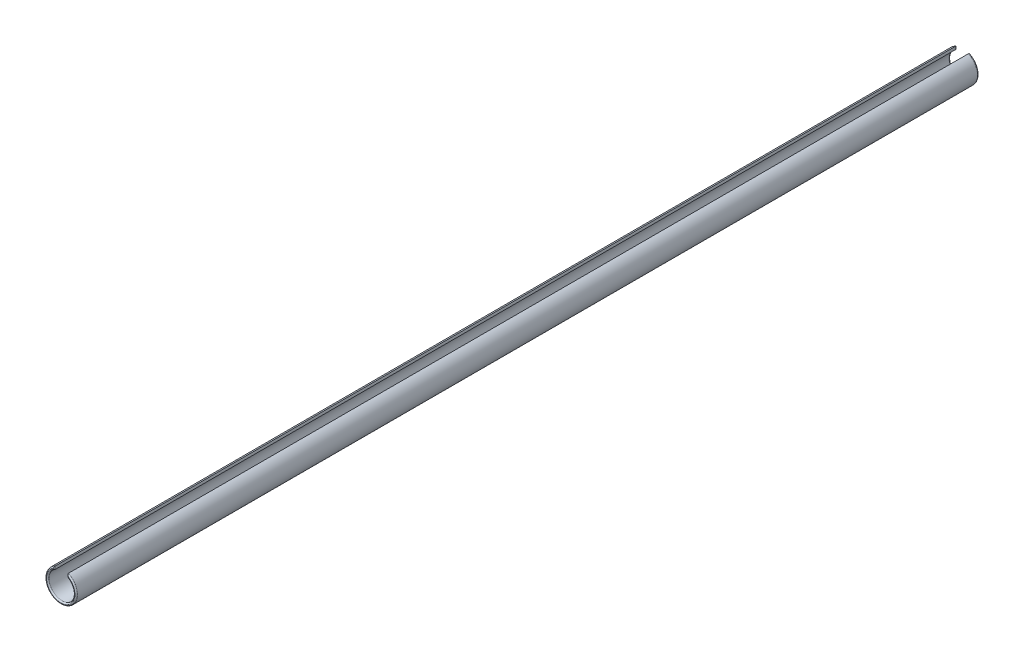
ISO-10303-21;
HEADER;
FILE_DESCRIPTION(('STEP AP214'),'2;1');
FILE_NAME('part.step','',(''),(''),'','','');
FILE_SCHEMA(('AUTOMOTIVE_DESIGN { 1 0 10303 214 1 1 1 1 }'));
ENDSEC;
DATA;
#1=APPLICATION_CONTEXT('core data for automotive mechanical design processes');
#2=APPLICATION_PROTOCOL_DEFINITION('international standard','automotive_design',2000,#1);
#3=PRODUCT_CONTEXT('',#1,'mechanical');
#4=PRODUCT('Part','Part','',(#3));
#5=PRODUCT_RELATED_PRODUCT_CATEGORY('part','',(#4));
#6=PRODUCT_DEFINITION_FORMATION('','',#4);
#7=PRODUCT_DEFINITION_CONTEXT('part definition',#1,'design');
#8=PRODUCT_DEFINITION('design','',#6,#7);
#9=PRODUCT_DEFINITION_SHAPE('','',#8);
#10=(LENGTH_UNIT() NAMED_UNIT(*) SI_UNIT(.MILLI.,.METRE.));
#11=(NAMED_UNIT(*) PLANE_ANGLE_UNIT() SI_UNIT($,.RADIAN.));
#12=(NAMED_UNIT(*) SI_UNIT($,.STERADIAN.) SOLID_ANGLE_UNIT());
#13=UNCERTAINTY_MEASURE_WITH_UNIT(LENGTH_MEASURE(1.E-05),#10,'distance_accuracy_value','');
#14=(GEOMETRIC_REPRESENTATION_CONTEXT(3) GLOBAL_UNCERTAINTY_ASSIGNED_CONTEXT((#13)) GLOBAL_UNIT_ASSIGNED_CONTEXT((#10,
#11,#12)) REPRESENTATION_CONTEXT('',''));
#15=CARTESIAN_POINT('',(0.,0.,0.));
#16=DIRECTION('',(0.,0.,1.));
#17=DIRECTION('',(1.,0.,0.));
#18=AXIS2_PLACEMENT_3D('',#15,#16,#17);
#19=CARTESIAN_POINT('',(0.,0.,35.));
#20=DIRECTION('',(0.,0.,-1.));
#21=DIRECTION('',(-1.,0.,0.));
#22=AXIS2_PLACEMENT_3D('',#19,#20,#21);
#23=CYLINDRICAL_SURFACE('',#22,0.6);
#24=DIRECTION('',(0.,0.,-1.));
#25=VECTOR('',#24,1.);
#26=CARTESIAN_POINT('',(-0.249999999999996,0.545435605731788,35.));
#27=LINE('',#26,#25);
#28=CARTESIAN_POINT('',(-0.249999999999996,0.545435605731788,0.0499999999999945));
#29=VERTEX_POINT('',#28);
#30=CARTESIAN_POINT('',(-0.249999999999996,0.545435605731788,34.95));
#31=VERTEX_POINT('',#30);
#32=EDGE_CURVE('E205',#29,#31,#27,.F.);
#33=ORIENTED_EDGE('',*,*,#32,.F.);
#34=CARTESIAN_POINT('',(0.,0.,0.0500000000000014));
#35=DIRECTION('',(0.,0.,1.));
#36=DIRECTION('',(1.,0.,0.));
#37=AXIS2_PLACEMENT_3D('',#34,#35,#36);
#38=CIRCLE('',#37,0.6);
#39=CARTESIAN_POINT('',(0.250000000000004,0.545435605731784,0.0499999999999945));
#40=VERTEX_POINT('',#39);
#41=EDGE_CURVE('E11',#29,#40,#38,.T.);
#42=ORIENTED_EDGE('',*,*,#41,.T.);
#43=DIRECTION('',(0.,0.,-1.));
#44=VECTOR('',#43,1.);
#45=CARTESIAN_POINT('',(0.250000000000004,0.545435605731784,35.));
#46=LINE('',#45,#44);
#47=CARTESIAN_POINT('',(0.250000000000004,0.545435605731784,34.95));
#48=VERTEX_POINT('',#47);
#49=EDGE_CURVE('E198',#48,#40,#46,.T.);
#50=ORIENTED_EDGE('',*,*,#49,.F.);
#51=CARTESIAN_POINT('',(0.,0.,34.95));
#52=DIRECTION('',(0.,0.,1.));
#53=DIRECTION('',(1.,0.,0.));
#54=AXIS2_PLACEMENT_3D('',#51,#52,#53);
#55=CIRCLE('',#54,0.6);
#56=EDGE_CURVE('E45',#48,#31,#55,.F.);
#57=ORIENTED_EDGE('',*,*,#56,.T.);
#58=EDGE_LOOP('',(#33,#42,#50,#57));
#59=FACE_BOUND('',#58,.T.);
#60=ADVANCED_FACE('F31',(#59),#23,.T.);
#61=CARTESIAN_POINT('',(0.,0.,0.));
#62=DIRECTION('',(0.,0.,1.));
#63=DIRECTION('',(1.,0.,0.));
#64=AXIS2_PLACEMENT_3D('',#61,#62,#63);
#65=CYLINDRICAL_SURFACE('',#64,0.5);
#66=DIRECTION('',(0.,0.,1.));
#67=VECTOR('',#66,1.);
#68=CARTESIAN_POINT('',(0.25,0.433012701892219,0.));
#69=LINE('',#68,#67);
#70=CARTESIAN_POINT('',(0.25,0.433012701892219,0.05));
#71=VERTEX_POINT('',#70);
#72=CARTESIAN_POINT('',(0.25,0.433012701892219,34.95));
#73=VERTEX_POINT('',#72);
#74=EDGE_CURVE('E197',#71,#73,#69,.T.);
#75=ORIENTED_EDGE('',*,*,#74,.F.);
#76=CARTESIAN_POINT('',(0.,0.,0.05));
#77=DIRECTION('',(0.,0.,1.));
#78=DIRECTION('',(1.,0.,0.));
#79=AXIS2_PLACEMENT_3D('',#76,#77,#78);
#80=CIRCLE('',#79,0.5);
#81=CARTESIAN_POINT('',(-0.25,0.433012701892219,0.05));
#82=VERTEX_POINT('',#81);
#83=EDGE_CURVE('E186',#71,#82,#80,.F.);
#84=ORIENTED_EDGE('',*,*,#83,.T.);
#85=DIRECTION('',(0.,0.,1.));
#86=VECTOR('',#85,1.);
#87=CARTESIAN_POINT('',(-0.25,0.433012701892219,0.));
#88=LINE('',#87,#86);
#89=CARTESIAN_POINT('',(-0.25,0.433012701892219,34.95));
#90=VERTEX_POINT('',#89);
#91=EDGE_CURVE('E201',#90,#82,#88,.F.);
#92=ORIENTED_EDGE('',*,*,#91,.F.);
#93=CARTESIAN_POINT('',(0.,0.,34.95));
#94=DIRECTION('',(0.,0.,1.));
#95=DIRECTION('',(1.,0.,0.));
#96=AXIS2_PLACEMENT_3D('',#93,#94,#95);
#97=CIRCLE('',#96,0.5);
#98=EDGE_CURVE('E192',#90,#73,#97,.T.);
#99=ORIENTED_EDGE('',*,*,#98,.T.);
#100=EDGE_LOOP('',(#75,#84,#92,#99));
#101=FACE_BOUND('',#100,.T.);
#102=ADVANCED_FACE('F127',(#101),#65,.F.);
#103=CARTESIAN_POINT('',(0.250000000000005,-0.601,35.6131131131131));
#104=DIRECTION('',(1.,0.,0.));
#105=DIRECTION('',(0.,0.,-1.));
#106=AXIS2_PLACEMENT_3D('',#103,#104,#105);
#107=PLANE('',#106);
#108=ORIENTED_EDGE('',*,*,#49,.T.);
#109=DIRECTION('',(0.,-1.,0.));
#110=VECTOR('',#109,1.);
#111=CARTESIAN_POINT('',(0.25,-0.601,0.0500000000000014));
#112=LINE('',#111,#110);
#113=EDGE_CURVE('E183',#40,#71,#112,.T.);
#114=ORIENTED_EDGE('',*,*,#113,.T.);
#115=ORIENTED_EDGE('',*,*,#74,.T.);
#116=DIRECTION('',(0.,-1.,0.));
#117=VECTOR('',#116,1.);
#118=CARTESIAN_POINT('',(0.250000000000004,0.545435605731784,34.95));
#119=LINE('',#118,#117);
#120=EDGE_CURVE('E93',#73,#48,#119,.F.);
#121=ORIENTED_EDGE('',*,*,#120,.T.);
#122=EDGE_LOOP('',(#108,#114,#115,#121));
#123=FACE_BOUND('',#122,.T.);
#124=ADVANCED_FACE('F132',(#123),#107,.F.);
#125=CARTESIAN_POINT('',(-0.249999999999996,-0.601,35.6131131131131));
#126=DIRECTION('',(-1.,0.,0.));
#127=DIRECTION('',(0.,0.,1.));
#128=AXIS2_PLACEMENT_3D('',#125,#126,#127);
#129=PLANE('',#128);
#130=ORIENTED_EDGE('',*,*,#91,.T.);
#131=DIRECTION('',(0.,1.,0.));
#132=VECTOR('',#131,1.);
#133=CARTESIAN_POINT('',(-0.25,-0.601,0.0500000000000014));
#134=LINE('',#133,#132);
#135=EDGE_CURVE('E211',#82,#29,#134,.T.);
#136=ORIENTED_EDGE('',*,*,#135,.T.);
#137=ORIENTED_EDGE('',*,*,#32,.T.);
#138=DIRECTION('',(0.,1.,0.));
#139=VECTOR('',#138,1.);
#140=CARTESIAN_POINT('',(-0.249999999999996,0.433012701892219,34.95));
#141=LINE('',#140,#139);
#142=EDGE_CURVE('E191',#31,#90,#141,.F.);
#143=ORIENTED_EDGE('',*,*,#142,.T.);
#144=EDGE_LOOP('',(#130,#136,#137,#143));
#145=FACE_BOUND('',#144,.T.);
#146=ADVANCED_FACE('F161',(#145),#129,.F.);
#147=CARTESIAN_POINT('',(-0.3,-0.601,0.0500000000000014));
#148=DIRECTION('',(0.,1.,0.));
#149=DIRECTION('',(0.,0.,1.));
#150=AXIS2_PLACEMENT_3D('',#147,#148,#149);
#151=CYLINDRICAL_SURFACE('',#150,0.05);
#152=CARTESIAN_POINT('',(-0.249999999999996,0.545435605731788,0.049999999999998));
#153=CARTESIAN_POINT('',(-0.249997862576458,0.545438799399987,0.0483828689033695));
#154=CARTESIAN_POINT('',(-0.250078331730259,0.545313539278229,0.0467699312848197));
#155=CARTESIAN_POINT('',(-0.250385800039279,0.544834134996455,0.0436065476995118));
#156=CARTESIAN_POINT('',(-0.250611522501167,0.544481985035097,0.0420556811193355));
#157=CARTESIAN_POINT('',(-0.251190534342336,0.543577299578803,0.0390455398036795));
#158=CARTESIAN_POINT('',(-0.251543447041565,0.543025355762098,0.0375860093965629));
#159=CARTESIAN_POINT('',(-0.252353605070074,0.541755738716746,0.0347693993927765));
#160=CARTESIAN_POINT('',(-0.252811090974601,0.541037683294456,0.0334125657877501));
#161=CARTESIAN_POINT('',(-0.254146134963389,0.538937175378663,0.0299276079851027));
#162=CARTESIAN_POINT('',(-0.255098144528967,0.537434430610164,0.0279005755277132));
#163=CARTESIAN_POINT('',(-0.257150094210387,0.534179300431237,0.0241449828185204));
#164=CARTESIAN_POINT('',(-0.258250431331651,0.532426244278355,0.0224172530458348));
#165=CARTESIAN_POINT('',(-0.261342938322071,0.527471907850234,0.0181126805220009));
#166=CARTESIAN_POINT('',(-0.263422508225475,0.524112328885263,0.0157825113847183));
#167=CARTESIAN_POINT('',(-0.267702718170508,0.517124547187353,0.0117173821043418));
#168=CARTESIAN_POINT('',(-0.269903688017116,0.513495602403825,0.00998414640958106));
#169=CARTESIAN_POINT('',(-0.276626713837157,0.502285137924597,0.00546545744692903));
#170=CARTESIAN_POINT('',(-0.281222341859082,0.494453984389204,0.00341463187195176));
#171=CARTESIAN_POINT('',(-0.290330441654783,0.478541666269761,0.00071693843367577));
#172=CARTESIAN_POINT('',(-0.294842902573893,0.470460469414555,7.0252564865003E-05));
#173=CARTESIAN_POINT('',(-0.299508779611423,0.461882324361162,1.82765757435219E-06));
#174=CARTESIAN_POINT('',(-0.299754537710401,0.461429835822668,2.2613212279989E-08));
#175=CARTESIAN_POINT('',(-0.3,0.460977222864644,0.));
#176=B_SPLINE_CURVE_WITH_KNOTS('',3,(#152,#153,#154,#155,#156,#157,#158,#159,#160,#161,#162,
#163,#164,#165,#166,#167,#168,#169,#170,#171,#172,#173,#174,#175),.UNSPECIFIED.,.F.,.F.,(4,2,2,
2,2,2,2,2,2,2,2,4),(0.,0.00483788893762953,0.00963382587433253,0.0144156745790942,
0.0192086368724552,0.0272526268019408,0.0353185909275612,0.0490021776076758,0.0627249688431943,
0.0904705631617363,0.118219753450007,0.119764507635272),.UNSPECIFIED.);
#177=CARTESIAN_POINT('',(-0.29999999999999,0.460977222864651,0.));
#178=VERTEX_POINT('',#177);
#179=EDGE_CURVE('E103',#29,#178,#176,.T.);
#180=ORIENTED_EDGE('',*,*,#179,.F.);
#181=ORIENTED_EDGE('',*,*,#135,.F.);
#182=CARTESIAN_POINT('',(-0.25,0.433012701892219,0.05));
#183=CARTESIAN_POINT('',(-0.249996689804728,0.433010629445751,0.0474512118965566));
#184=CARTESIAN_POINT('',(-0.250194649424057,0.433125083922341,0.0449054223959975));
#185=CARTESIAN_POINT('',(-0.250966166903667,0.43357025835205,0.0399019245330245));
#186=CARTESIAN_POINT('',(-0.251538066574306,0.433900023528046,0.0374438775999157));
#187=CARTESIAN_POINT('',(-0.253030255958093,0.434758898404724,0.032676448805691));
#188=CARTESIAN_POINT('',(-0.253950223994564,0.435287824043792,0.0303669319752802));
#189=CARTESIAN_POINT('',(-0.256097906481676,0.436519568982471,0.0259448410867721));
#190=CARTESIAN_POINT('',(-0.257325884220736,0.43722253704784,0.0238324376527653));
#191=CARTESIAN_POINT('',(-0.260117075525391,0.43881568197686,0.0197374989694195));
#192=CARTESIAN_POINT('',(-0.261694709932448,0.439713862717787,0.0177679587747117));
#193=CARTESIAN_POINT('',(-0.265088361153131,0.441639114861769,0.0141197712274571));
#194=CARTESIAN_POINT('',(-0.266904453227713,0.442666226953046,0.0124412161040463));
#195=CARTESIAN_POINT('',(-0.270969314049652,0.444956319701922,0.00919790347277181));
#196=CARTESIAN_POINT('',(-0.273243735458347,0.446232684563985,0.00767477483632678));
#197=CARTESIAN_POINT('',(-0.277970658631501,0.448873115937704,0.00503281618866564));
#198=CARTESIAN_POINT('',(-0.280423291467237,0.450237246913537,0.00391428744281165));
#199=CARTESIAN_POINT('',(-0.285470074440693,0.453030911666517,0.00208178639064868));
#200=CARTESIAN_POINT('',(-0.288065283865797,0.454460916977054,0.00137147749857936));
#201=CARTESIAN_POINT('',(-0.293319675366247,0.457342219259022,0.000376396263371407));
#202=CARTESIAN_POINT('',(-0.295978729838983,0.458793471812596,9.08369759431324E-05));
#203=CARTESIAN_POINT('',(-0.299094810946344,0.460486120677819,6.13692392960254E-06));
#204=CARTESIAN_POINT('',(-0.299547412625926,0.460731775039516,-1.10153104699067E-08));
#205=CARTESIAN_POINT('',(-0.3,0.460977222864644,0.));
#206=B_SPLINE_CURVE_WITH_KNOTS('',3,(#182,#183,#184,#185,#186,#187,#188,#189,#190,#191,#192,
#193,#194,#195,#196,#197,#198,#199,#200,#201,#202,#203,#204,#205),.UNSPECIFIED.,.F.,.F.,(4,2,2,
2,2,2,2,2,2,2,2,4),(0.,0.00763141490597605,0.0152292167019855,0.0228200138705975,
0.0304173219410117,0.0384211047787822,0.0464274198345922,0.0554520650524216,0.064483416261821,
0.0735945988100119,0.0826888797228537,0.0842337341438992),.UNSPECIFIED.);
#207=EDGE_CURVE('E151',#178,#82,#206,.F.);
#208=ORIENTED_EDGE('',*,*,#207,.F.);
#209=EDGE_LOOP('',(#180,#181,#208));
#210=FACE_BOUND('',#209,.T.);
#211=ADVANCED_FACE('F158',(#210),#151,.T.);
#212=CARTESIAN_POINT('',(0.,0.,0.0500000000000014));
#213=DIRECTION('',(0.,0.,1.));
#214=DIRECTION('',(1.,0.,0.));
#215=AXIS2_PLACEMENT_3D('',#212,#213,#214);
#216=TOROIDAL_SURFACE('',#215,0.55,0.05);
#217=ORIENTED_EDGE('',*,*,#41,.F.);
#218=ORIENTED_EDGE('',*,*,#179,.T.);
#219=CARTESIAN_POINT('',(0.,0.,0.));
#220=DIRECTION('',(0.,0.,1.));
#221=DIRECTION('',(1.,0.,0.));
#222=AXIS2_PLACEMENT_3D('',#219,#220,#221);
#223=CIRCLE('',#222,0.55);
#224=CARTESIAN_POINT('',(0.3,0.460977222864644,0.));
#225=VERTEX_POINT('',#224);
#226=EDGE_CURVE('E157',#225,#178,#223,.F.);
#227=ORIENTED_EDGE('',*,*,#226,.F.);
#228=CARTESIAN_POINT('',(0.250000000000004,0.545435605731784,0.0499999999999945));
#229=CARTESIAN_POINT('',(0.249997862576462,0.545438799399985,0.0483828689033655));
#230=CARTESIAN_POINT('',(0.250078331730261,0.545313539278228,0.0467699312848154));
#231=CARTESIAN_POINT('',(0.250385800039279,0.544834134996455,0.0436065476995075));
#232=CARTESIAN_POINT('',(0.250611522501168,0.544481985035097,0.0420556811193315));
#233=CARTESIAN_POINT('',(0.251190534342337,0.543577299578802,0.0390455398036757));
#234=CARTESIAN_POINT('',(0.251543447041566,0.543025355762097,0.0375860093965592));
#235=CARTESIAN_POINT('',(0.252353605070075,0.541755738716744,0.0347693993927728));
#236=CARTESIAN_POINT('',(0.252811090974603,0.541037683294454,0.0334125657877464));
#237=CARTESIAN_POINT('',(0.254146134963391,0.53893717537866,0.0299276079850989));
#238=CARTESIAN_POINT('',(0.255098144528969,0.53743443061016,0.0279005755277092));
#239=CARTESIAN_POINT('',(0.25715009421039,0.534179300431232,0.0241449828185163));
#240=CARTESIAN_POINT('',(0.258250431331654,0.532426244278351,0.0224172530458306));
#241=CARTESIAN_POINT('',(0.261342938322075,0.527471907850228,0.0181126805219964));
#242=CARTESIAN_POINT('',(0.263422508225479,0.524112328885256,0.0157825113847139));
#243=CARTESIAN_POINT('',(0.267702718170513,0.517124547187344,0.0117173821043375));
#244=CARTESIAN_POINT('',(0.269903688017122,0.513495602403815,0.0099841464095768));
#245=CARTESIAN_POINT('',(0.276626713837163,0.502285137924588,0.00546545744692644));
#246=CARTESIAN_POINT('',(0.281222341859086,0.494453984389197,0.00341463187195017));
#247=CARTESIAN_POINT('',(0.290330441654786,0.478541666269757,0.000716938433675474));
#248=CARTESIAN_POINT('',(0.294842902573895,0.470460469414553,7.02525648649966E-05));
#249=CARTESIAN_POINT('',(0.299508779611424,0.461882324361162,1.82765757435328E-06));
#250=CARTESIAN_POINT('',(0.299754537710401,0.461429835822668,2.26132122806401E-08));
#251=CARTESIAN_POINT('',(0.3,0.460977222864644,0.));
#252=B_SPLINE_CURVE_WITH_KNOTS('',3,(#228,#229,#230,#231,#232,#233,#234,#235,#236,#237,#238,
#239,#240,#241,#242,#243,#244,#245,#246,#247,#248,#249,#250,#251),.UNSPECIFIED.,.F.,.F.,(4,2,2,
2,2,2,2,2,2,2,2,4),(0.,0.00483788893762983,0.00963382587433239,0.0144156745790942,
0.0192086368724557,0.0272526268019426,0.0353185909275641,0.0490021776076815,0.0627249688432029,
0.0904705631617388,0.118219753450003,0.119764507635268),.UNSPECIFIED.);
#253=EDGE_CURVE('E168',#40,#225,#252,.T.);
#254=ORIENTED_EDGE('',*,*,#253,.F.);
#255=EDGE_LOOP('',(#217,#218,#227,#254));
#256=FACE_BOUND('',#255,.T.);
#257=ADVANCED_FACE('F141',(#256),#216,.T.);
#258=CARTESIAN_POINT('',(0.,0.,0.05));
#259=DIRECTION('',(0.,0.,1.));
#260=DIRECTION('',(1.,0.,0.));
#261=AXIS2_PLACEMENT_3D('',#258,#259,#260);
#262=TOROIDAL_SURFACE('',#261,0.55,0.05);
#263=ORIENTED_EDGE('',*,*,#207,.T.);
#264=ORIENTED_EDGE('',*,*,#83,.F.);
#265=CARTESIAN_POINT('',(0.25,0.433012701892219,0.05));
#266=CARTESIAN_POINT('',(0.249996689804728,0.433010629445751,0.0474512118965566));
#267=CARTESIAN_POINT('',(0.250194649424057,0.43312508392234,0.0449054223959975));
#268=CARTESIAN_POINT('',(0.250966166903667,0.43357025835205,0.0399019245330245));
#269=CARTESIAN_POINT('',(0.251538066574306,0.433900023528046,0.0374438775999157));
#270=CARTESIAN_POINT('',(0.253030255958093,0.434758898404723,0.032676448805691));
#271=CARTESIAN_POINT('',(0.253950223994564,0.435287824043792,0.0303669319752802));
#272=CARTESIAN_POINT('',(0.256097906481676,0.436519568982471,0.0259448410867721));
#273=CARTESIAN_POINT('',(0.257325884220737,0.43722253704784,0.0238324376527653));
#274=CARTESIAN_POINT('',(0.260117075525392,0.43881568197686,0.0197374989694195));
#275=CARTESIAN_POINT('',(0.261694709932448,0.439713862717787,0.0177679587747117));
#276=CARTESIAN_POINT('',(0.265088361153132,0.441639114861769,0.0141197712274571));
#277=CARTESIAN_POINT('',(0.266904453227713,0.442666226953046,0.0124412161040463));
#278=CARTESIAN_POINT('',(0.270969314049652,0.444956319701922,0.00919790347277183));
#279=CARTESIAN_POINT('',(0.273243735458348,0.446232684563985,0.0076747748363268));
#280=CARTESIAN_POINT('',(0.277970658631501,0.448873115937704,0.00503281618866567));
#281=CARTESIAN_POINT('',(0.280423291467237,0.450237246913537,0.00391428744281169));
#282=CARTESIAN_POINT('',(0.285470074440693,0.453030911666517,0.0020817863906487));
#283=CARTESIAN_POINT('',(0.288065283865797,0.454460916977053,0.00137147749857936));
#284=CARTESIAN_POINT('',(0.293319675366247,0.457342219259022,0.000376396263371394));
#285=CARTESIAN_POINT('',(0.295978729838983,0.458793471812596,9.08369759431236E-05));
#286=CARTESIAN_POINT('',(0.299094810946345,0.460486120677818,6.13692392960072E-06));
#287=CARTESIAN_POINT('',(0.299547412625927,0.460731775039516,-1.10153104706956E-08));
#288=CARTESIAN_POINT('',(0.3,0.460977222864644,0.));
#289=B_SPLINE_CURVE_WITH_KNOTS('',3,(#265,#266,#267,#268,#269,#270,#271,#272,#273,#274,#275,
#276,#277,#278,#279,#280,#281,#282,#283,#284,#285,#286,#287,#288),.UNSPECIFIED.,.F.,.F.,(4,2,2,
2,2,2,2,2,2,2,2,4),(0.,0.00763141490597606,0.0152292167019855,0.0228200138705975,
0.0304173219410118,0.0384211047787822,0.0464274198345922,0.0554520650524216,0.0644834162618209,
0.0735945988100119,0.0826888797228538,0.0842337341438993),.UNSPECIFIED.);
#290=EDGE_CURVE('E146',#225,#71,#289,.F.);
#291=ORIENTED_EDGE('',*,*,#290,.F.);
#292=ORIENTED_EDGE('',*,*,#226,.T.);
#293=EDGE_LOOP('',(#263,#264,#291,#292));
#294=FACE_BOUND('',#293,.T.);
#295=ADVANCED_FACE('F137',(#294),#262,.T.);
#296=CARTESIAN_POINT('',(0.3,-0.601,0.0500000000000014));
#297=DIRECTION('',(0.,-1.,0.));
#298=DIRECTION('',(0.,0.,-1.));
#299=AXIS2_PLACEMENT_3D('',#296,#297,#298);
#300=CYLINDRICAL_SURFACE('',#299,0.05);
#301=ORIENTED_EDGE('',*,*,#113,.F.);
#302=ORIENTED_EDGE('',*,*,#253,.T.);
#303=ORIENTED_EDGE('',*,*,#290,.T.);
#304=EDGE_LOOP('',(#301,#302,#303));
#305=FACE_BOUND('',#304,.T.);
#306=ADVANCED_FACE('F125',(#305),#300,.T.);
#307=CARTESIAN_POINT('',(0.,0.,34.95));
#308=DIRECTION('',(0.,0.,1.));
#309=DIRECTION('',(1.,0.,0.));
#310=AXIS2_PLACEMENT_3D('',#307,#308,#309);
#311=TOROIDAL_SURFACE('',#310,0.55,0.05);
#312=CARTESIAN_POINT('',(-0.249999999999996,0.545435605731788,34.95));
#313=CARTESIAN_POINT('',(-0.249997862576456,0.545438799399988,34.9516171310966));
#314=CARTESIAN_POINT('',(-0.250078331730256,0.545313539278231,34.9532300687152));
#315=CARTESIAN_POINT('',(-0.250385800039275,0.544834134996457,34.9563934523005));
#316=CARTESIAN_POINT('',(-0.250611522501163,0.544481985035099,34.9579443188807));
#317=CARTESIAN_POINT('',(-0.251190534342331,0.543577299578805,34.9609544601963));
#318=CARTESIAN_POINT('',(-0.25154344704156,0.543025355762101,34.9624139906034));
#319=CARTESIAN_POINT('',(-0.252353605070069,0.541755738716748,34.9652306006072));
#320=CARTESIAN_POINT('',(-0.252811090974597,0.541037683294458,34.9665874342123));
#321=CARTESIAN_POINT('',(-0.254146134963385,0.538937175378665,34.9700723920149));
#322=CARTESIAN_POINT('',(-0.255098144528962,0.537434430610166,34.9720994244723));
#323=CARTESIAN_POINT('',(-0.257150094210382,0.534179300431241,34.9758550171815));
#324=CARTESIAN_POINT('',(-0.258250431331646,0.532426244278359,34.9775827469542));
#325=CARTESIAN_POINT('',(-0.261342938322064,0.52747190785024,34.981887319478));
#326=CARTESIAN_POINT('',(-0.263422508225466,0.524112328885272,34.9842174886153));
#327=CARTESIAN_POINT('',(-0.267702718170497,0.517124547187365,34.9882826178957));
#328=CARTESIAN_POINT('',(-0.269903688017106,0.513495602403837,34.9900158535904));
#329=CARTESIAN_POINT('',(-0.276626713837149,0.502285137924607,34.9945345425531));
#330=CARTESIAN_POINT('',(-0.281222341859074,0.494453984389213,34.996585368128));
#331=CARTESIAN_POINT('',(-0.290330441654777,0.478541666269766,34.9992830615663));
#332=CARTESIAN_POINT('',(-0.294842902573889,0.470460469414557,34.9999297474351));
#333=CARTESIAN_POINT('',(-0.29950877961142,0.461882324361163,34.9999981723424));
#334=CARTESIAN_POINT('',(-0.299754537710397,0.46142983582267,34.9999999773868));
#335=CARTESIAN_POINT('',(-0.299999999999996,0.460977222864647,35.));
#336=B_SPLINE_CURVE_WITH_KNOTS('',3,(#312,#313,#314,#315,#316,#317,#318,#319,#320,#321,#322,
#323,#324,#325,#326,#327,#328,#329,#330,#331,#332,#333,#334,#335),.UNSPECIFIED.,.F.,.F.,(4,2,2,
2,2,2,2,2,2,2,2,4),(0.,0.00483788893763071,0.00963382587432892,0.0144156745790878,
0.0192086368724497,0.027252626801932,0.035318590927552,0.0490021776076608,0.0627249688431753,
0.0904705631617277,0.118219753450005,0.119764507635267),.UNSPECIFIED.);
#337=CARTESIAN_POINT('',(-0.299999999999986,0.460977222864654,35.));
#338=VERTEX_POINT('',#337);
#339=EDGE_CURVE('E36',#31,#338,#336,.T.);
#340=ORIENTED_EDGE('',*,*,#339,.F.);
#341=ORIENTED_EDGE('',*,*,#56,.F.);
#342=CARTESIAN_POINT('',(0.250000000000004,0.545435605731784,34.95));
#343=CARTESIAN_POINT('',(0.249997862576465,0.545438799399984,34.9516171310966));
#344=CARTESIAN_POINT('',(0.250078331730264,0.545313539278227,34.9532300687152));
#345=CARTESIAN_POINT('',(0.250385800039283,0.544834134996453,34.9563934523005));
#346=CARTESIAN_POINT('',(0.250611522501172,0.544481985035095,34.9579443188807));
#347=CARTESIAN_POINT('',(0.25119053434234,0.543577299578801,34.9609544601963));
#348=CARTESIAN_POINT('',(0.251543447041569,0.543025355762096,34.9624139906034));
#349=CARTESIAN_POINT('',(0.252353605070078,0.541755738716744,34.9652306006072));
#350=CARTESIAN_POINT('',(0.252811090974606,0.541037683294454,34.9665874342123));
#351=CARTESIAN_POINT('',(0.254146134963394,0.538937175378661,34.9700723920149));
#352=CARTESIAN_POINT('',(0.255098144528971,0.537434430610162,34.9720994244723));
#353=CARTESIAN_POINT('',(0.25715009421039,0.534179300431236,34.9758550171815));
#354=CARTESIAN_POINT('',(0.258250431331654,0.532426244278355,34.9775827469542));
#355=CARTESIAN_POINT('',(0.261342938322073,0.527471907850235,34.981887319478));
#356=CARTESIAN_POINT('',(0.263422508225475,0.524112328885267,34.9842174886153));
#357=CARTESIAN_POINT('',(0.267702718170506,0.517124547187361,34.9882826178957));
#358=CARTESIAN_POINT('',(0.269903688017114,0.513495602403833,34.9900158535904));
#359=CARTESIAN_POINT('',(0.276626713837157,0.502285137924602,34.9945345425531));
#360=CARTESIAN_POINT('',(0.281222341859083,0.494453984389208,34.996585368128));
#361=CARTESIAN_POINT('',(0.290330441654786,0.47854166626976,34.9992830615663));
#362=CARTESIAN_POINT('',(0.294842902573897,0.470460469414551,34.9999297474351));
#363=CARTESIAN_POINT('',(0.299508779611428,0.461882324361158,34.9999981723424));
#364=CARTESIAN_POINT('',(0.299754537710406,0.461429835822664,34.9999999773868));
#365=CARTESIAN_POINT('',(0.300000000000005,0.460977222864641,35.));
#366=B_SPLINE_CURVE_WITH_KNOTS('',3,(#342,#343,#344,#345,#346,#347,#348,#349,#350,#351,#352,
#353,#354,#355,#356,#357,#358,#359,#360,#361,#362,#363,#364,#365),.UNSPECIFIED.,.F.,.F.,(4,2,2,
2,2,2,2,2,2,2,2,4),(0.,0.00483788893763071,0.00963382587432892,0.0144156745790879,
0.0192086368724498,0.0272526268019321,0.0353185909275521,0.049002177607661,0.0627249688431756,
0.0904705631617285,0.118219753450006,0.119764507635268),.UNSPECIFIED.);
#367=CARTESIAN_POINT('',(0.299999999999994,0.460977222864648,35.));
#368=VERTEX_POINT('',#367);
#369=EDGE_CURVE('E76',#368,#48,#366,.F.);
#370=ORIENTED_EDGE('',*,*,#369,.F.);
#371=CARTESIAN_POINT('',(0.,0.,35.));
#372=DIRECTION('',(0.,0.,1.));
#373=DIRECTION('',(1.,0.,0.));
#374=AXIS2_PLACEMENT_3D('',#371,#372,#373);
#375=CIRCLE('',#374,0.55);
#376=EDGE_CURVE('E78',#338,#368,#375,.T.);
#377=ORIENTED_EDGE('',*,*,#376,.F.);
#378=EDGE_LOOP('',(#340,#341,#370,#377));
#379=FACE_BOUND('',#378,.T.);
#380=ADVANCED_FACE('F33',(#379),#311,.T.);
#381=CARTESIAN_POINT('',(-0.299999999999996,0.,34.95));
#382=DIRECTION('',(0.,-1.,0.));
#383=DIRECTION('',(0.,0.,-1.));
#384=AXIS2_PLACEMENT_3D('',#381,#382,#383);
#385=CYLINDRICAL_SURFACE('',#384,0.05);
#386=ORIENTED_EDGE('',*,*,#142,.F.);
#387=ORIENTED_EDGE('',*,*,#339,.T.);
#388=CARTESIAN_POINT('',(-0.25,0.433012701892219,34.95));
#389=CARTESIAN_POINT('',(-0.249996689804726,0.433010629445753,34.9525487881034));
#390=CARTESIAN_POINT('',(-0.250194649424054,0.433125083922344,34.955094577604));
#391=CARTESIAN_POINT('',(-0.250966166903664,0.433570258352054,34.960098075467));
#392=CARTESIAN_POINT('',(-0.251538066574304,0.43390002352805,34.9625561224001));
#393=CARTESIAN_POINT('',(-0.253030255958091,0.434758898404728,34.9673235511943));
#394=CARTESIAN_POINT('',(-0.253950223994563,0.435287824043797,34.9696330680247));
#395=CARTESIAN_POINT('',(-0.256097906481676,0.436519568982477,34.9740551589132));
#396=CARTESIAN_POINT('',(-0.257325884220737,0.437222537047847,34.9761675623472));
#397=CARTESIAN_POINT('',(-0.260117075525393,0.438815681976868,34.9802625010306));
#398=CARTESIAN_POINT('',(-0.261694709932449,0.439713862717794,34.9822320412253));
#399=CARTESIAN_POINT('',(-0.265088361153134,0.441639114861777,34.9858802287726));
#400=CARTESIAN_POINT('',(-0.266904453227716,0.442666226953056,34.987558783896));
#401=CARTESIAN_POINT('',(-0.270969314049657,0.444956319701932,34.9908020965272));
#402=CARTESIAN_POINT('',(-0.273243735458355,0.446232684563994,34.9923252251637));
#403=CARTESIAN_POINT('',(-0.277970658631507,0.448873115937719,34.9949671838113));
#404=CARTESIAN_POINT('',(-0.28042329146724,0.450237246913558,34.9960857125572));
#405=CARTESIAN_POINT('',(-0.285470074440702,0.453030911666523,34.9979182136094));
#406=CARTESIAN_POINT('',(-0.288065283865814,0.454460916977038,34.9986285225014));
#407=CARTESIAN_POINT('',(-0.293319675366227,0.457342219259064,34.9996236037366));
#408=CARTESIAN_POINT('',(-0.295978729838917,0.458793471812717,34.9999091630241));
#409=CARTESIAN_POINT('',(-0.299094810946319,0.460486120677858,34.9999938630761));
#410=CARTESIAN_POINT('',(-0.29954741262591,0.46073177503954,35.0000000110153));
#411=CARTESIAN_POINT('',(-0.299999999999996,0.460977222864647,35.));
#412=B_SPLINE_CURVE_WITH_KNOTS('',3,(#388,#389,#390,#391,#392,#393,#394,#395,#396,#397,#398,
#399,#400,#401,#402,#403,#404,#405,#406,#407,#408,#409,#410,#411),.UNSPECIFIED.,.F.,.F.,(4,2,2,
2,2,2,2,2,2,2,2,4),(0.,0.00763141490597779,0.0152292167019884,0.0228200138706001,
0.0304173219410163,0.0384211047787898,0.0464274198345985,0.0554520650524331,0.0644834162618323,
0.0735945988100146,0.0826888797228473,0.0842337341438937),.UNSPECIFIED.);
#413=EDGE_CURVE('E89',#90,#338,#412,.T.);
#414=ORIENTED_EDGE('',*,*,#413,.F.);
#415=EDGE_LOOP('',(#386,#387,#414));
#416=FACE_BOUND('',#415,.T.);
#417=ADVANCED_FACE('F116',(#416),#385,.T.);
#418=CARTESIAN_POINT('',(0.300000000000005,0.,34.95));
#419=DIRECTION('',(0.,1.,0.));
#420=DIRECTION('',(0.,0.,1.));
#421=AXIS2_PLACEMENT_3D('',#418,#419,#420);
#422=CYLINDRICAL_SURFACE('',#421,0.05);
#423=ORIENTED_EDGE('',*,*,#369,.T.);
#424=ORIENTED_EDGE('',*,*,#120,.F.);
#425=CARTESIAN_POINT('',(0.25,0.433012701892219,34.95));
#426=CARTESIAN_POINT('',(0.249996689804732,0.43301062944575,34.9525487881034));
#427=CARTESIAN_POINT('',(0.250194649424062,0.433125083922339,34.955094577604));
#428=CARTESIAN_POINT('',(0.250966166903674,0.433570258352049,34.960098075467));
#429=CARTESIAN_POINT('',(0.251538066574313,0.433900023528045,34.9625561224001));
#430=CARTESIAN_POINT('',(0.2530302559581,0.434758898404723,34.9673235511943));
#431=CARTESIAN_POINT('',(0.253950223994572,0.435287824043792,34.9696330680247));
#432=CARTESIAN_POINT('',(0.256097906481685,0.436519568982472,34.9740551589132));
#433=CARTESIAN_POINT('',(0.257325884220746,0.437222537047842,34.9761675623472));
#434=CARTESIAN_POINT('',(0.260117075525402,0.438815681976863,34.9802625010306));
#435=CARTESIAN_POINT('',(0.261694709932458,0.439713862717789,34.9822320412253));
#436=CARTESIAN_POINT('',(0.265088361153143,0.441639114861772,34.9858802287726));
#437=CARTESIAN_POINT('',(0.266904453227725,0.442666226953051,34.987558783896));
#438=CARTESIAN_POINT('',(0.270969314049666,0.444956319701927,34.9908020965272));
#439=CARTESIAN_POINT('',(0.273243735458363,0.446232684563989,34.9923252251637));
#440=CARTESIAN_POINT('',(0.277970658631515,0.448873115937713,34.9949671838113));
#441=CARTESIAN_POINT('',(0.280423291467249,0.450237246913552,34.9960857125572));
#442=CARTESIAN_POINT('',(0.285470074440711,0.453030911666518,34.9979182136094));
#443=CARTESIAN_POINT('',(0.288065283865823,0.454460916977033,34.9986285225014));
#444=CARTESIAN_POINT('',(0.293319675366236,0.457342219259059,34.9996236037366));
#445=CARTESIAN_POINT('',(0.295978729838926,0.458793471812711,34.9999091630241));
#446=CARTESIAN_POINT('',(0.299094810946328,0.460486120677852,34.9999938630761));
#447=CARTESIAN_POINT('',(0.299547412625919,0.460731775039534,35.0000000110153));
#448=CARTESIAN_POINT('',(0.300000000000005,0.460977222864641,35.));
#449=B_SPLINE_CURVE_WITH_KNOTS('',3,(#425,#426,#427,#428,#429,#430,#431,#432,#433,#434,#435,
#436,#437,#438,#439,#440,#441,#442,#443,#444,#445,#446,#447,#448),.UNSPECIFIED.,.F.,.F.,(4,2,2,
2,2,2,2,2,2,2,2,4),(0.,0.00763141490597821,0.0152292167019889,0.0228200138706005,
0.0304173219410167,0.0384211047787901,0.046427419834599,0.0554520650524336,0.0644834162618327,
0.0735945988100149,0.0826888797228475,0.0842337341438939),.UNSPECIFIED.);
#450=EDGE_CURVE('E88',#368,#73,#449,.F.);
#451=ORIENTED_EDGE('',*,*,#450,.F.);
#452=EDGE_LOOP('',(#423,#424,#451));
#453=FACE_BOUND('',#452,.T.);
#454=ADVANCED_FACE('F91',(#453),#422,.T.);
#455=CARTESIAN_POINT('',(0.,0.,34.95));
#456=DIRECTION('',(0.,0.,1.));
#457=DIRECTION('',(1.,0.,0.));
#458=AXIS2_PLACEMENT_3D('',#455,#456,#457);
#459=TOROIDAL_SURFACE('',#458,0.55,0.05);
#460=ORIENTED_EDGE('',*,*,#413,.T.);
#461=ORIENTED_EDGE('',*,*,#376,.T.);
#462=ORIENTED_EDGE('',*,*,#450,.T.);
#463=ORIENTED_EDGE('',*,*,#98,.F.);
#464=EDGE_LOOP('',(#460,#461,#462,#463));
#465=FACE_BOUND('',#464,.T.);
#466=ADVANCED_FACE('F85',(#465),#459,.T.);
#467=CLOSED_SHELL('',(#60,#102,#124,#146,#211,#257,#295,#306,#380,#417,#454,#466));
#468=MANIFOLD_SOLID_BREP('B2',#467);
#469=ADVANCED_BREP_SHAPE_REPRESENTATION('',(#18,#468),#14);
#470=SHAPE_DEFINITION_REPRESENTATION(#9,#469);
ENDSEC;
END-ISO-10303-21;
